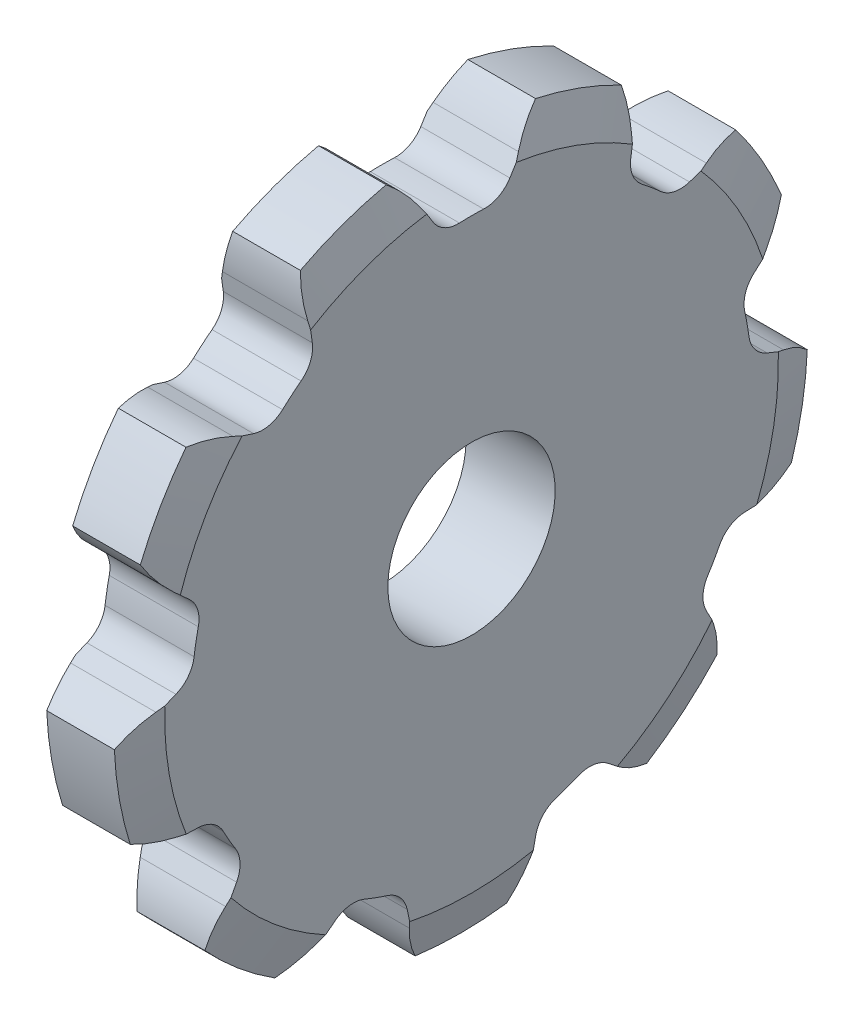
from build123d import *

# Parameters (mm, degrees)
TOOTHCUT_DEPTH  = 152.293123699
TEETHCUTS_COUNT = 9
TEETHCUTS_ANGLE = 320
BORSKE_R        = 25.4
BORE_DEPTH      = 76.2000508


with BuildPart() as part:
    # BasProSke → Base-Revolve (revolve)
    with BuildSketch(Plane(origin=(0, 0, 0), x_dir=(1, 0, 0), z_dir=(0, 1, 0)), mode=Mode.PRIVATE) as base_revolve_sk:
        Polygon((0, 0), (0, 93.156431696), (3.243072, 105.259741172), (23.782528, 105.259741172), (27.0256, 93.156431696), (27.0256, 0), align=None)
    revolve(base_revolve_sk.sketch.rotate(Axis((-10, 0, 0), (1, 0, 0)), 180), axis=Axis((-10, 0, 0), (1, 0, 0)))

    # TooCutSke → ToothCut (cut, through all)
    with BuildSketch(Plane(origin=(0, 0, 0), x_dir=(0, 0, -1), z_dir=(1, 0, 0))):
        with BuildLine():
            Line((-11.639118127, 89.055413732), (-14.799648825, 94.113320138))
            ThreePointArc((-14.799648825, 94.113320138), (-25.527429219, 104.770164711), (-39.873178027, 109.550656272))
            Line((-39.873178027, 109.550656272), (-44.216833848, 121.484752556))
            ThreePointArc((-44.216833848, 121.484752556), (0, 129.281373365), (44.216833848, 121.484752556))
            Line((44.216833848, 121.484752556), (39.873178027, 109.550656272))
            ThreePointArc((39.873178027, 109.550656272), (25.527429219, 104.770164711), (14.799648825, 94.113320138))
            Line((14.799648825, 94.113320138), (11.639118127, 89.055413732))
            ThreePointArc((11.639118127, 89.055413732), (8.221464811, 85.88166506), (3.670530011, 84.860867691))
            ThreePointArc((3.670530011, 84.860867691), (0, 84.940212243), (-3.670530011, 84.860867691))
            ThreePointArc((-3.670530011, 84.860867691), (-8.221464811, 85.88166506), (-11.639118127, 89.055413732))
        make_face()
    toothcut = extrude(amount=TOOTHCUT_DEPTH, mode=Mode.SUBTRACT)

    # TeethCuts: ToothCut ×9 about axis
    teethcuts_axis = Axis((-10, 0, 0), (1, 0, 0))
    for i in range(1, TEETHCUTS_COUNT):
        add(toothcut.rotate(teethcuts_axis, i * TEETHCUTS_ANGLE / (TEETHCUTS_COUNT - 1)), mode=Mode.SUBTRACT)

    # BorSke → Bore (cut, symmetric)
    with BuildSketch(Plane(origin=(0, 0, 0), x_dir=(0, 0, -1), z_dir=(1, 0, 0))):
        with Locations(Location((0, 0, 0), (0, 0, 180))):
            Circle(BORSKE_R)
    extrude(amount=BORE_DEPTH, both=True, mode=Mode.SUBTRACT)


solid = part.part
